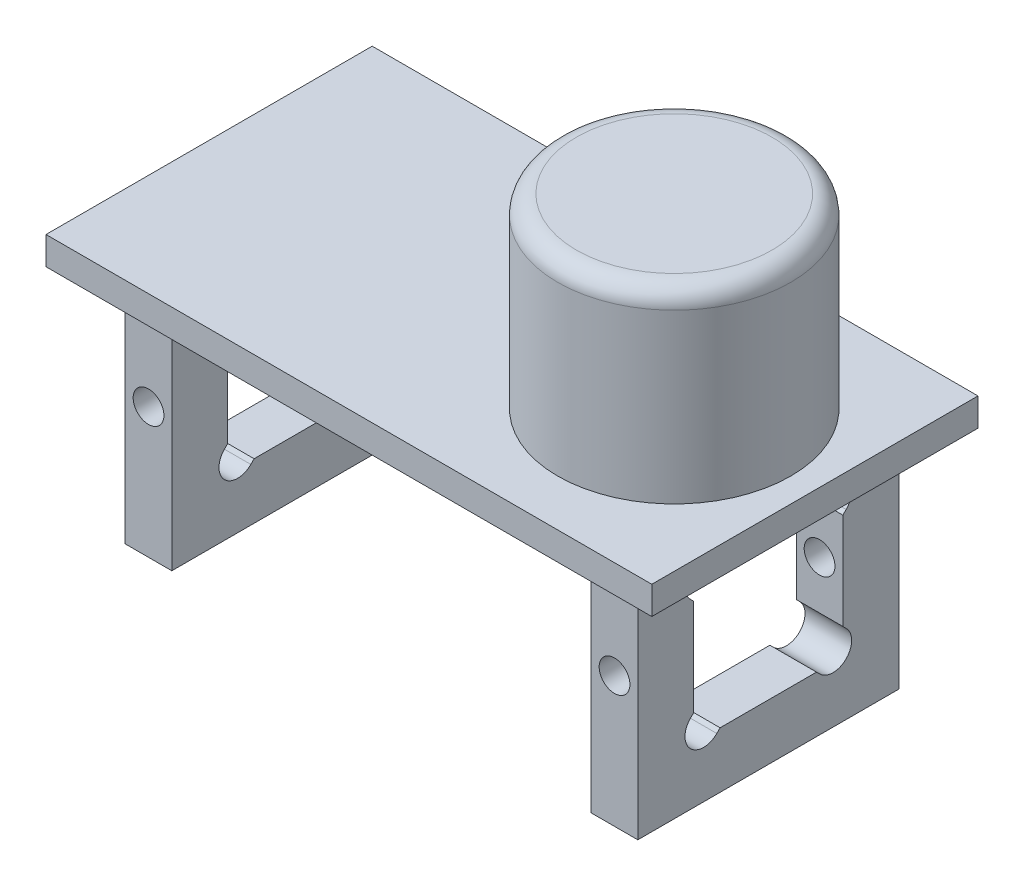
from build123d import *

# Parameters (mm, degrees)
ESQUISSE1_W                = 65
ESQUISSE1_H                = 3
BOSS_EXTRU_1_DEPTH         = 17.5
ESQUISSE2_R                = 12.5
BOSS_EXTRU_2_DEPTH         = 20
BOSS_EXTRU_3_START         = -5
ESQUISSE4_W                = 28
ESQUISSE4_H                = 25
ESQUISSE4_W_2              = 16
ESQUISSE4_H_2              = 16
BOSS_EXTRU_3_DEPTH         = 5
R_P_TITION_LIN_AIRE1_COUNT = 2
R_P_TITION_LIN_AIRE1_PITCH = 50
CONG_1_R                   = 2
ENL_V_MAT_EXTRU_1_DEPTH    = 68.314560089
TROU_TARAUD_M41_D          = 3.3


with BuildPart() as part:
    # Esquisse1 → Boss.-Extru.1 (new, symmetric)
    with BuildSketch(Plane.XY):
        with Locations((32.5, 1.5)):
            Rectangle(ESQUISSE1_W, ESQUISSE1_H)
    extrude(amount=BOSS_EXTRU_1_DEPTH, both=True)

    # Esquisse2 → Boss.-Extru.2 (add)
    with BuildSketch(Plane(origin=(0, 3, 0), x_dir=(1, 0, 0), z_dir=(0, 1, 0))):
        with Locations(Location((49.907315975, 0, 0), (0, 0, 90))):
            Circle(ESQUISSE2_R)
    extrude(amount=BOSS_EXTRU_2_DEPTH)

    # Esquisse4 → Boss.-Extru.3 (add)
    with BuildSketch(Plane.ZY.offset(BOSS_EXTRU_3_START)):
        with Locations((0, -12.5)):
            Rectangle(ESQUISSE4_W, ESQUISSE4_H)
        with Locations((0, -11)):
            Rectangle(ESQUISSE4_W_2, ESQUISSE4_H_2, mode=Mode.SUBTRACT)
    boss_extru_3 = extrude(amount=-BOSS_EXTRU_3_DEPTH)

    # R_p_tition lin_aire1: Boss.-Extru.3 ×2
    with Locations(*[(i * R_P_TITION_LIN_AIRE1_PITCH, 0, 0) for i in range(1, R_P_TITION_LIN_AIRE1_COUNT)]):
        add(boss_extru_3)

    # Cong_1
    cong_1_edges = [part.edges().sort_by_distance(p)[0] for p in [
        (49.907315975, 23, 12.5),
    ]]
    fillet(cong_1_edges, radius=CONG_1_R)

    # Esquisse5 → Enl_v. mat.-Extru.1 (cut, through all)
    with BuildSketch(Plane(origin=(60, 0, 0), x_dir=(0, 0, -1), z_dir=(1, 0, 0))):
        with BuildLine():
            Line((-5.525126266, -2.646446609), (-5.171572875, -3))
            Line((-5.171572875, -3), (-8, -5.828427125))
            Line((-8, -5.828427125), (-8.353553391, -5.474873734))
            ThreePointArc((-8.353553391, -5.474873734), (-8.353553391, -2.646446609), (-5.525126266, -2.646446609))
        make_face()
        with BuildLine():
            Line((8.353553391, -5.474873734), (8, -5.828427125))
            Line((8, -5.828427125), (5.171572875, -3))
            Line((5.171572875, -3), (5.525126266, -2.646446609))
            ThreePointArc((5.525126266, -2.646446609), (8.353553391, -2.646446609), (8.353553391, -5.474873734))
        make_face()
        with BuildLine():
            Line((5.525126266, -19.353553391), (5.171572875, -19))
            Line((5.171572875, -19), (8, -16.171572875))
            Line((8, -16.171572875), (8.353553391, -16.525126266))
            ThreePointArc((8.353553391, -16.525126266), (8.353553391, -19.353553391), (5.525126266, -19.353553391))
        make_face()
        with BuildLine():
            Line((-8.353553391, -16.525126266), (-8, -16.171572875))
            Line((-8, -16.171572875), (-5.171572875, -19))
            Line((-5.171572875, -19), (-5.525126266, -19.353553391))
            ThreePointArc((-5.525126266, -19.353553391), (-8.353553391, -19.353553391), (-8.353553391, -16.525126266))
        make_face()
    extrude(amount=-ENL_V_MAT_EXTRU_1_DEPTH, mode=Mode.SUBTRACT)

    # Trou taraud_ M41 (through all)
    with Locations(Plane.XY.offset(14)):
        with Locations((57.5, -11), (7.5, -11)):
            Hole(TROU_TARAUD_M41_D / 2)


solid = part.part
